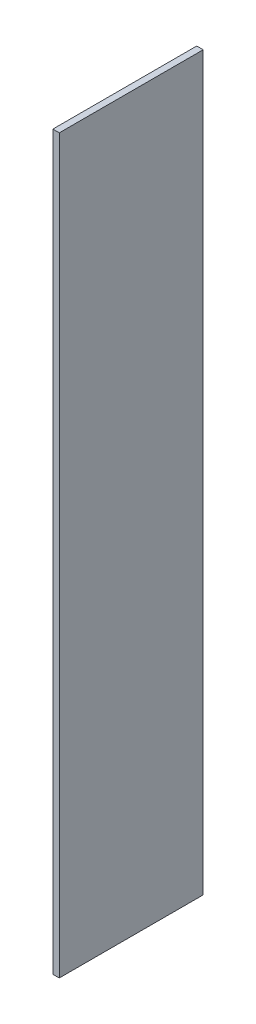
ISO-10303-21;
HEADER;
FILE_DESCRIPTION(('STEP AP214'),'2;1');
FILE_NAME('part.step','',(''),(''),'','','');
FILE_SCHEMA(('AUTOMOTIVE_DESIGN { 1 0 10303 214 1 1 1 1 }'));
ENDSEC;
DATA;
#1=APPLICATION_CONTEXT('core data for automotive mechanical design processes');
#2=APPLICATION_PROTOCOL_DEFINITION('international standard','automotive_design',2000,#1);
#3=PRODUCT_CONTEXT('',#1,'mechanical');
#4=PRODUCT('Part','Part','',(#3));
#5=PRODUCT_RELATED_PRODUCT_CATEGORY('part','',(#4));
#6=PRODUCT_DEFINITION_FORMATION('','',#4);
#7=PRODUCT_DEFINITION_CONTEXT('part definition',#1,'design');
#8=PRODUCT_DEFINITION('design','',#6,#7);
#9=PRODUCT_DEFINITION_SHAPE('','',#8);
#10=(LENGTH_UNIT() NAMED_UNIT(*) SI_UNIT(.MILLI.,.METRE.));
#11=(NAMED_UNIT(*) PLANE_ANGLE_UNIT() SI_UNIT($,.RADIAN.));
#12=(NAMED_UNIT(*) SI_UNIT($,.STERADIAN.) SOLID_ANGLE_UNIT());
#13=UNCERTAINTY_MEASURE_WITH_UNIT(LENGTH_MEASURE(1.E-05),#10,'distance_accuracy_value','');
#14=(GEOMETRIC_REPRESENTATION_CONTEXT(3) GLOBAL_UNCERTAINTY_ASSIGNED_CONTEXT((#13)) GLOBAL_UNIT_ASSIGNED_CONTEXT((#10,
#11,#12)) REPRESENTATION_CONTEXT('',''));
#15=CARTESIAN_POINT('',(0.,0.,0.));
#16=DIRECTION('',(0.,0.,1.));
#17=DIRECTION('',(1.,0.,0.));
#18=AXIS2_PLACEMENT_3D('',#15,#16,#17);
#19=CARTESIAN_POINT('',(2.54,143.51,-28.2194));
#20=DIRECTION('',(0.,0.,1.));
#21=DIRECTION('',(0.,-1.,0.));
#22=AXIS2_PLACEMENT_3D('',#19,#20,#21);
#23=PLANE('',#22);
#24=DIRECTION('',(0.,1.,0.));
#25=VECTOR('',#24,1.);
#26=CARTESIAN_POINT('',(0.,143.51,-28.2194));
#27=LINE('',#26,#25);
#28=CARTESIAN_POINT('',(0.,-143.51,-28.2194));
#29=VERTEX_POINT('',#28);
#30=CARTESIAN_POINT('',(0.,143.51,-28.2194));
#31=VERTEX_POINT('',#30);
#32=EDGE_CURVE('E100',#29,#31,#27,.T.);
#33=ORIENTED_EDGE('',*,*,#32,.T.);
#34=DIRECTION('',(-1.,0.,0.));
#35=VECTOR('',#34,1.);
#36=CARTESIAN_POINT('',(2.54,143.51,-28.2194));
#37=LINE('',#36,#35);
#38=CARTESIAN_POINT('',(2.54,143.51,-28.2194));
#39=VERTEX_POINT('',#38);
#40=EDGE_CURVE('E11',#39,#31,#37,.T.);
#41=ORIENTED_EDGE('',*,*,#40,.F.);
#42=DIRECTION('',(0.,1.,0.));
#43=VECTOR('',#42,1.);
#44=CARTESIAN_POINT('',(2.54,143.51,-28.2194));
#45=LINE('',#44,#43);
#46=CARTESIAN_POINT('',(2.54,-143.51,-28.2194));
#47=VERTEX_POINT('',#46);
#48=EDGE_CURVE('E88',#47,#39,#45,.T.);
#49=ORIENTED_EDGE('',*,*,#48,.F.);
#50=DIRECTION('',(-1.,0.,0.));
#51=VECTOR('',#50,1.);
#52=CARTESIAN_POINT('',(2.54,-143.51,-28.2194));
#53=LINE('',#52,#51);
#54=EDGE_CURVE('E96',#47,#29,#53,.T.);
#55=ORIENTED_EDGE('',*,*,#54,.T.);
#56=EDGE_LOOP('',(#33,#41,#49,#55));
#57=FACE_BOUND('',#56,.T.);
#58=ADVANCED_FACE('F37',(#57),#23,.F.);
#59=CARTESIAN_POINT('',(2.54,143.51,28.2194));
#60=DIRECTION('',(0.,-1.,0.));
#61=DIRECTION('',(0.,0.,-1.));
#62=AXIS2_PLACEMENT_3D('',#59,#60,#61);
#63=PLANE('',#62);
#64=DIRECTION('',(0.,0.,1.));
#65=VECTOR('',#64,1.);
#66=CARTESIAN_POINT('',(0.,143.51,28.2194));
#67=LINE('',#66,#65);
#68=CARTESIAN_POINT('',(0.,143.51,28.2194));
#69=VERTEX_POINT('',#68);
#70=EDGE_CURVE('E92',#31,#69,#67,.T.);
#71=ORIENTED_EDGE('',*,*,#70,.T.);
#72=DIRECTION('',(-1.,0.,0.));
#73=VECTOR('',#72,1.);
#74=CARTESIAN_POINT('',(2.54,143.51,28.2194));
#75=LINE('',#74,#73);
#76=CARTESIAN_POINT('',(2.54,143.51,28.2194));
#77=VERTEX_POINT('',#76);
#78=EDGE_CURVE('E45',#77,#69,#75,.T.);
#79=ORIENTED_EDGE('',*,*,#78,.F.);
#80=DIRECTION('',(0.,0.,1.));
#81=VECTOR('',#80,1.);
#82=CARTESIAN_POINT('',(2.54,143.51,28.2194));
#83=LINE('',#82,#81);
#84=EDGE_CURVE('E83',#39,#77,#83,.T.);
#85=ORIENTED_EDGE('',*,*,#84,.F.);
#86=ORIENTED_EDGE('',*,*,#40,.T.);
#87=EDGE_LOOP('',(#71,#79,#85,#86));
#88=FACE_BOUND('',#87,.T.);
#89=ADVANCED_FACE('F91',(#88),#63,.F.);
#90=CARTESIAN_POINT('',(2.54,143.51,28.2194));
#91=DIRECTION('',(0.,0.,-1.));
#92=DIRECTION('',(0.,1.,0.));
#93=AXIS2_PLACEMENT_3D('',#90,#91,#92);
#94=PLANE('',#93);
#95=DIRECTION('',(0.,-1.,0.));
#96=VECTOR('',#95,1.);
#97=CARTESIAN_POINT('',(0.,143.51,28.2194));
#98=LINE('',#97,#96);
#99=CARTESIAN_POINT('',(0.,-143.51,28.2194));
#100=VERTEX_POINT('',#99);
#101=EDGE_CURVE('E70',#69,#100,#98,.T.);
#102=ORIENTED_EDGE('',*,*,#101,.T.);
#103=DIRECTION('',(-1.,0.,0.));
#104=VECTOR('',#103,1.);
#105=CARTESIAN_POINT('',(2.54,-143.51,28.2194));
#106=LINE('',#105,#104);
#107=CARTESIAN_POINT('',(2.54,-143.51,28.2194));
#108=VERTEX_POINT('',#107);
#109=EDGE_CURVE('E93',#108,#100,#106,.T.);
#110=ORIENTED_EDGE('',*,*,#109,.F.);
#111=DIRECTION('',(0.,-1.,0.));
#112=VECTOR('',#111,1.);
#113=CARTESIAN_POINT('',(2.54,143.51,28.2194));
#114=LINE('',#113,#112);
#115=EDGE_CURVE('E86',#77,#108,#114,.T.);
#116=ORIENTED_EDGE('',*,*,#115,.F.);
#117=ORIENTED_EDGE('',*,*,#78,.T.);
#118=EDGE_LOOP('',(#102,#110,#116,#117));
#119=FACE_BOUND('',#118,.T.);
#120=ADVANCED_FACE('F94',(#119),#94,.F.);
#121=CARTESIAN_POINT('',(2.54,-143.51,28.2194));
#122=DIRECTION('',(0.,1.,0.));
#123=DIRECTION('',(0.,0.,1.));
#124=AXIS2_PLACEMENT_3D('',#121,#122,#123);
#125=PLANE('',#124);
#126=DIRECTION('',(0.,0.,-1.));
#127=VECTOR('',#126,1.);
#128=CARTESIAN_POINT('',(0.,-143.51,28.2194));
#129=LINE('',#128,#127);
#130=EDGE_CURVE('E76',#100,#29,#129,.T.);
#131=ORIENTED_EDGE('',*,*,#130,.T.);
#132=ORIENTED_EDGE('',*,*,#54,.F.);
#133=DIRECTION('',(0.,0.,-1.));
#134=VECTOR('',#133,1.);
#135=CARTESIAN_POINT('',(2.54,-143.51,28.2194));
#136=LINE('',#135,#134);
#137=EDGE_CURVE('E53',#108,#47,#136,.T.);
#138=ORIENTED_EDGE('',*,*,#137,.F.);
#139=ORIENTED_EDGE('',*,*,#109,.T.);
#140=EDGE_LOOP('',(#131,#132,#138,#139));
#141=FACE_BOUND('',#140,.T.);
#142=ADVANCED_FACE('F107',(#141),#125,.F.);
#143=CARTESIAN_POINT('',(2.54,0.,0.));
#144=DIRECTION('',(1.,0.,0.));
#145=DIRECTION('',(0.,0.,-1.));
#146=AXIS2_PLACEMENT_3D('',#143,#144,#145);
#147=PLANE('',#146);
#148=ORIENTED_EDGE('',*,*,#48,.T.);
#149=ORIENTED_EDGE('',*,*,#84,.T.);
#150=ORIENTED_EDGE('',*,*,#115,.T.);
#151=ORIENTED_EDGE('',*,*,#137,.T.);
#152=EDGE_LOOP('',(#148,#149,#150,#151));
#153=FACE_BOUND('',#152,.T.);
#154=ADVANCED_FACE('F84',(#153),#147,.T.);
#155=CARTESIAN_POINT('',(0.,0.,0.));
#156=DIRECTION('',(1.,0.,0.));
#157=DIRECTION('',(0.,0.,-1.));
#158=AXIS2_PLACEMENT_3D('',#155,#156,#157);
#159=PLANE('',#158);
#160=ORIENTED_EDGE('',*,*,#32,.F.);
#161=ORIENTED_EDGE('',*,*,#130,.F.);
#162=ORIENTED_EDGE('',*,*,#101,.F.);
#163=ORIENTED_EDGE('',*,*,#70,.F.);
#164=EDGE_LOOP('',(#160,#161,#162,#163));
#165=FACE_BOUND('',#164,.T.);
#166=ADVANCED_FACE('F110',(#165),#159,.F.);
#167=CLOSED_SHELL('',(#58,#89,#120,#142,#154,#166));
#168=MANIFOLD_SOLID_BREP('B2',#167);
#169=ADVANCED_BREP_SHAPE_REPRESENTATION('',(#18,#168),#14);
#170=SHAPE_DEFINITION_REPRESENTATION(#9,#169);
ENDSEC;
END-ISO-10303-21;
